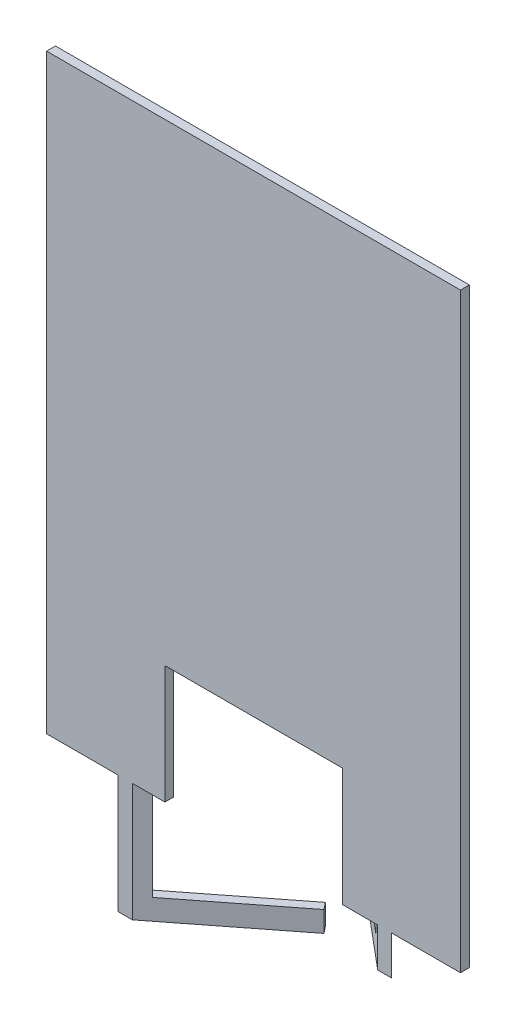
ISO-10303-21;
HEADER;
FILE_DESCRIPTION(('STEP AP214'),'2;1');
FILE_NAME('part.step','',(''),(''),'','','');
FILE_SCHEMA(('AUTOMOTIVE_DESIGN { 1 0 10303 214 1 1 1 1 }'));
ENDSEC;
DATA;
#1=APPLICATION_CONTEXT('core data for automotive mechanical design processes');
#2=APPLICATION_PROTOCOL_DEFINITION('international standard','automotive_design',2000,#1);
#3=PRODUCT_CONTEXT('',#1,'mechanical');
#4=PRODUCT('Part','Part','',(#3));
#5=PRODUCT_RELATED_PRODUCT_CATEGORY('part','',(#4));
#6=PRODUCT_DEFINITION_FORMATION('','',#4);
#7=PRODUCT_DEFINITION_CONTEXT('part definition',#1,'design');
#8=PRODUCT_DEFINITION('design','',#6,#7);
#9=PRODUCT_DEFINITION_SHAPE('','',#8);
#10=(LENGTH_UNIT() NAMED_UNIT(*) SI_UNIT(.MILLI.,.METRE.));
#11=(NAMED_UNIT(*) PLANE_ANGLE_UNIT() SI_UNIT($,.RADIAN.));
#12=(NAMED_UNIT(*) SI_UNIT($,.STERADIAN.) SOLID_ANGLE_UNIT());
#13=UNCERTAINTY_MEASURE_WITH_UNIT(LENGTH_MEASURE(1.E-05),#10,'distance_accuracy_value','');
#14=(GEOMETRIC_REPRESENTATION_CONTEXT(3) GLOBAL_UNCERTAINTY_ASSIGNED_CONTEXT((#13)) GLOBAL_UNIT_ASSIGNED_CONTEXT((#10,
#11,#12)) REPRESENTATION_CONTEXT('',''));
#15=CARTESIAN_POINT('',(0.,0.,0.));
#16=DIRECTION('',(0.,0.,1.));
#17=DIRECTION('',(1.,0.,0.));
#18=AXIS2_PLACEMENT_3D('',#15,#16,#17);
#19=CARTESIAN_POINT('',(88.9,-254.,3.81));
#20=DIRECTION('',(0.,1.,0.));
#21=DIRECTION('',(0.,0.,1.));
#22=AXIS2_PLACEMENT_3D('',#19,#20,#21);
#23=PLANE('',#22);
#24=DIRECTION('',(1.,0.,0.));
#25=VECTOR('',#24,1.);
#26=CARTESIAN_POINT('',(88.9,-254.,3.81));
#27=LINE('',#26,#25);
#28=CARTESIAN_POINT('',(38.1,-254.,3.81));
#29=VERTEX_POINT('',#28);
#30=CARTESIAN_POINT('',(53.34,-254.,3.81));
#31=VERTEX_POINT('',#30);
#32=EDGE_CURVE('E251',#29,#31,#27,.T.);
#33=ORIENTED_EDGE('',*,*,#32,.F.);
#34=DIRECTION('',(0.,0.,-1.));
#35=VECTOR('',#34,1.);
#36=CARTESIAN_POINT('',(38.1,-254.,3.81));
#37=LINE('',#36,#35);
#38=CARTESIAN_POINT('',(38.1,-254.,0.));
#39=VERTEX_POINT('',#38);
#40=EDGE_CURVE('E237',#29,#39,#37,.T.);
#41=ORIENTED_EDGE('',*,*,#40,.T.);
#42=DIRECTION('',(1.,0.,0.));
#43=VECTOR('',#42,1.);
#44=CARTESIAN_POINT('',(88.9,-254.,0.));
#45=LINE('',#44,#43);
#46=CARTESIAN_POINT('',(48.7994188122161,-254.,0.));
#47=VERTEX_POINT('',#46);
#48=EDGE_CURVE('E286',#39,#47,#45,.T.);
#49=ORIENTED_EDGE('',*,*,#48,.T.);
#50=DIRECTION('',(0.766044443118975,0.,0.642787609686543));
#51=VECTOR('',#50,1.);
#52=CARTESIAN_POINT('',(74.2074645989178,-254.,21.3198818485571));
#53=LINE('',#52,#51);
#54=EDGE_CURVE('E258',#47,#31,#53,.T.);
#55=ORIENTED_EDGE('',*,*,#54,.T.);
#56=EDGE_LOOP('',(#33,#41,#49,#55));
#57=FACE_BOUND('',#56,.T.);
#58=ADVANCED_FACE('F35',(#57),#23,.F.);
#59=CARTESIAN_POINT('',(59.2673077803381,-147.32,3.81));
#60=DIRECTION('',(0.642787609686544,0.,-0.766044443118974));
#61=DIRECTION('',(-0.766044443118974,0.,-0.642787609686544));
#62=AXIS2_PLACEMENT_3D('',#59,#60,#61);
#63=PLANE('',#62);
#64=DIRECTION('',(0.766044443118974,0.,0.642787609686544));
#65=VECTOR('',#64,1.);
#66=CARTESIAN_POINT('',(59.2673077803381,-156.21,3.81));
#67=LINE('',#66,#65);
#68=CARTESIAN_POINT('',(14.5149914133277,-156.21,-33.7416521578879));
#69=VERTEX_POINT('',#68);
#70=CARTESIAN_POINT('',(54.7267265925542,-156.21,0.));
#71=VERTEX_POINT('',#70);
#72=EDGE_CURVE('E451',#69,#71,#67,.T.);
#73=ORIENTED_EDGE('',*,*,#72,.F.);
#74=DIRECTION('',(0.,-1.,0.));
#75=VECTOR('',#74,1.);
#76=CARTESIAN_POINT('',(14.5149914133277,-147.32,-33.7416521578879));
#77=LINE('',#76,#75);
#78=CARTESIAN_POINT('',(14.5149914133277,-147.32,-33.7416521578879));
#79=VERTEX_POINT('',#78);
#80=EDGE_CURVE('E346',#79,#69,#77,.T.);
#81=ORIENTED_EDGE('',*,*,#80,.F.);
#82=DIRECTION('',(0.766044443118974,0.,0.642787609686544));
#83=VECTOR('',#82,1.);
#84=CARTESIAN_POINT('',(59.2673077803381,-147.32,3.81));
#85=LINE('',#84,#83);
#86=CARTESIAN_POINT('',(54.7267265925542,-147.32,0.));
#87=VERTEX_POINT('',#86);
#88=EDGE_CURVE('E382',#79,#87,#85,.T.);
#89=ORIENTED_EDGE('',*,*,#88,.T.);
#90=DIRECTION('',(0.,1.,0.));
#91=VECTOR('',#90,1.);
#92=CARTESIAN_POINT('',(54.7267265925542,0.,0.));
#93=LINE('',#92,#91);
#94=EDGE_CURVE('E307',#71,#87,#93,.T.);
#95=ORIENTED_EDGE('',*,*,#94,.F.);
#96=EDGE_LOOP('',(#73,#81,#89,#95));
#97=FACE_BOUND('',#96,.T.);
#98=ADVANCED_FACE('F575',(#97),#63,.T.);
#99=CARTESIAN_POINT('',(12.0659706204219,-147.32,-30.8230228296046));
#100=DIRECTION('',(-0.642787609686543,0.,0.766044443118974));
#101=DIRECTION('',(0.766044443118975,0.,0.642787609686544));
#102=AXIS2_PLACEMENT_3D('',#99,#100,#101);
#103=PLANE('',#102);
#104=DIRECTION('',(-0.766044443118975,0.,-0.642787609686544));
#105=VECTOR('',#104,1.);
#106=CARTESIAN_POINT('',(12.0659706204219,-156.21,-30.8230228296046));
#107=LINE('',#106,#105);
#108=CARTESIAN_POINT('',(48.7994188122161,-156.21,0.));
#109=VERTEX_POINT('',#108);
#110=CARTESIAN_POINT('',(12.0659706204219,-156.21,-30.8230228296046));
#111=VERTEX_POINT('',#110);
#112=EDGE_CURVE('E449',#109,#111,#107,.T.);
#113=ORIENTED_EDGE('',*,*,#112,.F.);
#114=DIRECTION('',(0.,-1.,0.));
#115=VECTOR('',#114,1.);
#116=CARTESIAN_POINT('',(48.7994188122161,0.,0.));
#117=LINE('',#116,#115);
#118=CARTESIAN_POINT('',(48.7994188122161,-147.32,0.));
#119=VERTEX_POINT('',#118);
#120=EDGE_CURVE('E304',#119,#109,#117,.T.);
#121=ORIENTED_EDGE('',*,*,#120,.F.);
#122=DIRECTION('',(-0.766044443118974,0.,-0.642787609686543));
#123=VECTOR('',#122,1.);
#124=CARTESIAN_POINT('',(12.0659706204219,-147.32,-30.8230228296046));
#125=LINE('',#124,#123);
#126=CARTESIAN_POINT('',(12.0659706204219,-147.32,-30.8230228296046));
#127=VERTEX_POINT('',#126);
#128=EDGE_CURVE('E368',#119,#127,#125,.T.);
#129=ORIENTED_EDGE('',*,*,#128,.T.);
#130=DIRECTION('',(0.,-1.,0.));
#131=VECTOR('',#130,1.);
#132=CARTESIAN_POINT('',(12.0659706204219,-147.32,-30.8230228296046));
#133=LINE('',#132,#131);
#134=EDGE_CURVE('E387',#127,#111,#133,.T.);
#135=ORIENTED_EDGE('',*,*,#134,.T.);
#136=EDGE_LOOP('',(#113,#121,#129,#135));
#137=FACE_BOUND('',#136,.T.);
#138=ADVANCED_FACE('F579',(#137),#103,.T.);
#139=CARTESIAN_POINT('',(14.5149914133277,-147.32,-33.7416521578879));
#140=DIRECTION('',(-0.766044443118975,0.,-0.642787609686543));
#141=DIRECTION('',(-0.642787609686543,0.,0.766044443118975));
#142=AXIS2_PLACEMENT_3D('',#139,#140,#141);
#143=PLANE('',#142);
#144=DIRECTION('',(0.642787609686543,0.,-0.766044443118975));
#145=VECTOR('',#144,1.);
#146=CARTESIAN_POINT('',(14.5149914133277,-156.21,-33.7416521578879));
#147=LINE('',#146,#145);
#148=EDGE_CURVE('E328',#111,#69,#147,.T.);
#149=ORIENTED_EDGE('',*,*,#148,.F.);
#150=ORIENTED_EDGE('',*,*,#134,.F.);
#151=DIRECTION('',(0.642787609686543,0.,-0.766044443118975));
#152=VECTOR('',#151,1.);
#153=CARTESIAN_POINT('',(14.5149914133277,-147.32,-33.7416521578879));
#154=LINE('',#153,#152);
#155=EDGE_CURVE('E379',#127,#79,#154,.T.);
#156=ORIENTED_EDGE('',*,*,#155,.T.);
#157=ORIENTED_EDGE('',*,*,#80,.T.);
#158=EDGE_LOOP('',(#149,#150,#156,#157));
#159=FACE_BOUND('',#158,.T.);
#160=ADVANCED_FACE('F708',(#159),#143,.T.);
#161=CARTESIAN_POINT('',(0.,0.,0.));
#162=DIRECTION('',(0.,0.,1.));
#163=DIRECTION('',(1.,0.,0.));
#164=AXIS2_PLACEMENT_3D('',#161,#162,#163);
#165=PLANE('',#164);
#166=DIRECTION('',(1.,0.,0.));
#167=VECTOR('',#166,1.);
#168=CARTESIAN_POINT('',(12.0659706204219,-156.21,0.));
#169=LINE('',#168,#167);
#170=EDGE_CURVE('E441',#109,#71,#169,.T.);
#171=ORIENTED_EDGE('',*,*,#170,.T.);
#172=ORIENTED_EDGE('',*,*,#94,.T.);
#173=DIRECTION('',(1.,0.,0.));
#174=VECTOR('',#173,1.);
#175=CARTESIAN_POINT('',(0.,-147.32,0.));
#176=LINE('',#175,#174);
#177=EDGE_CURVE('E301',#119,#87,#176,.T.);
#178=ORIENTED_EDGE('',*,*,#177,.F.);
#179=ORIENTED_EDGE('',*,*,#120,.T.);
#180=EDGE_LOOP('',(#171,#172,#178,#179));
#181=FACE_BOUND('',#180,.T.);
#182=ORIENTED_EDGE('',*,*,#48,.F.);
#183=DIRECTION('',(0.,-1.,0.));
#184=VECTOR('',#183,1.);
#185=CARTESIAN_POINT('',(38.1,-254.,0.));
#186=LINE('',#185,#184);
#187=CARTESIAN_POINT('',(38.1,-203.2,0.));
#188=VERTEX_POINT('',#187);
#189=EDGE_CURVE('E242',#188,#39,#186,.T.);
#190=ORIENTED_EDGE('',*,*,#189,.F.);
#191=DIRECTION('',(1.,0.,0.));
#192=VECTOR('',#191,1.);
#193=CARTESIAN_POINT('',(38.1,-203.2,0.));
#194=LINE('',#193,#192);
#195=CARTESIAN_POINT('',(-38.1,-203.2,0.));
#196=VERTEX_POINT('',#195);
#197=EDGE_CURVE('E255',#196,#188,#194,.T.);
#198=ORIENTED_EDGE('',*,*,#197,.F.);
#199=DIRECTION('',(0.,1.,0.));
#200=VECTOR('',#199,1.);
#201=CARTESIAN_POINT('',(-38.1,-254.,0.));
#202=LINE('',#201,#200);
#203=CARTESIAN_POINT('',(-38.1,-254.,0.));
#204=VERTEX_POINT('',#203);
#205=EDGE_CURVE('E426',#204,#196,#202,.T.);
#206=ORIENTED_EDGE('',*,*,#205,.F.);
#207=CARTESIAN_POINT('',(-47.1934223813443,-254.,0.));
#208=VERTEX_POINT('',#207);
#209=EDGE_CURVE('E285',#208,#204,#45,.T.);
#210=ORIENTED_EDGE('',*,*,#209,.F.);
#211=DIRECTION('',(0.,-1.,0.));
#212=VECTOR('',#211,1.);
#213=CARTESIAN_POINT('',(-47.1934223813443,-114.3,0.));
#214=LINE('',#213,#212);
#215=CARTESIAN_POINT('',(-47.1934223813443,-295.91,0.));
#216=VERTEX_POINT('',#215);
#217=EDGE_CURVE('E422',#208,#216,#214,.T.);
#218=ORIENTED_EDGE('',*,*,#217,.T.);
#219=DIRECTION('',(-1.,0.,0.));
#220=VECTOR('',#219,1.);
#221=CARTESIAN_POINT('',(-5.87411275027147,-295.91,0.));
#222=LINE('',#221,#220);
#223=CARTESIAN_POINT('',(-53.3818882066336,-295.91,0.));
#224=VERTEX_POINT('',#223);
#225=EDGE_CURVE('E475',#216,#224,#222,.T.);
#226=ORIENTED_EDGE('',*,*,#225,.T.);
#227=DIRECTION('',(0.,1.,0.));
#228=VECTOR('',#227,1.);
#229=CARTESIAN_POINT('',(-53.3818882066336,-114.3,0.));
#230=LINE('',#229,#228);
#231=CARTESIAN_POINT('',(-53.3818882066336,-254.,0.));
#232=VERTEX_POINT('',#231);
#233=EDGE_CURVE('E324',#224,#232,#230,.T.);
#234=ORIENTED_EDGE('',*,*,#233,.T.);
#235=CARTESIAN_POINT('',(-88.9,-254.,0.));
#236=VERTEX_POINT('',#235);
#237=EDGE_CURVE('E281',#236,#232,#45,.T.);
#238=ORIENTED_EDGE('',*,*,#237,.F.);
#239=DIRECTION('',(0.,-1.,0.));
#240=VECTOR('',#239,1.);
#241=CARTESIAN_POINT('',(-88.9,-254.,0.));
#242=LINE('',#241,#240);
#243=CARTESIAN_POINT('',(-88.9,0.,0.));
#244=VERTEX_POINT('',#243);
#245=EDGE_CURVE('E277',#244,#236,#242,.T.);
#246=ORIENTED_EDGE('',*,*,#245,.F.);
#247=DIRECTION('',(-1.,0.,0.));
#248=VECTOR('',#247,1.);
#249=CARTESIAN_POINT('',(88.9,0.,0.));
#250=LINE('',#249,#248);
#251=CARTESIAN_POINT('',(88.9,0.,0.));
#252=VERTEX_POINT('',#251);
#253=EDGE_CURVE('E288',#252,#244,#250,.T.);
#254=ORIENTED_EDGE('',*,*,#253,.F.);
#255=DIRECTION('',(0.,1.,0.));
#256=VECTOR('',#255,1.);
#257=CARTESIAN_POINT('',(88.9,-254.,0.));
#258=LINE('',#257,#256);
#259=CARTESIAN_POINT('',(88.9,-254.,0.));
#260=VERTEX_POINT('',#259);
#261=EDGE_CURVE('E284',#260,#252,#258,.T.);
#262=ORIENTED_EDGE('',*,*,#261,.F.);
#263=CARTESIAN_POINT('',(54.7267265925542,-254.,0.));
#264=VERTEX_POINT('',#263);
#265=EDGE_CURVE('E279',#264,#260,#45,.T.);
#266=ORIENTED_EDGE('',*,*,#265,.F.);
#267=DIRECTION('',(0.,-1.,0.));
#268=VECTOR('',#267,1.);
#269=CARTESIAN_POINT('',(54.7267265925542,-147.32,0.));
#270=LINE('',#269,#268);
#271=CARTESIAN_POINT('',(54.7267265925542,-261.874,0.));
#272=VERTEX_POINT('',#271);
#273=EDGE_CURVE('E407',#264,#272,#270,.T.);
#274=ORIENTED_EDGE('',*,*,#273,.T.);
#275=DIRECTION('',(1.,0.,0.));
#276=VECTOR('',#275,1.);
#277=CARTESIAN_POINT('',(12.0659706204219,-261.874,0.));
#278=LINE('',#277,#276);
#279=CARTESIAN_POINT('',(48.7994188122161,-261.874,0.));
#280=VERTEX_POINT('',#279);
#281=EDGE_CURVE('E336',#280,#272,#278,.T.);
#282=ORIENTED_EDGE('',*,*,#281,.F.);
#283=DIRECTION('',(0.,1.,0.));
#284=VECTOR('',#283,1.);
#285=CARTESIAN_POINT('',(48.7994188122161,-147.32,0.));
#286=LINE('',#285,#284);
#287=EDGE_CURVE('E43',#280,#47,#286,.T.);
#288=ORIENTED_EDGE('',*,*,#287,.T.);
#289=EDGE_LOOP('',(#182,#190,#198,#206,#210,#218,#226,#234,#238,#246,#254,#262,#266,#274,#282,#288));
#290=FACE_BOUND('',#289,.T.);
#291=DIRECTION('',(1.,0.,0.));
#292=VECTOR('',#291,1.);
#293=CARTESIAN_POINT('',(-5.87411275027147,-116.84,0.));
#294=LINE('',#293,#292);
#295=CARTESIAN_POINT('',(-47.1934223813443,-116.84,0.));
#296=VERTEX_POINT('',#295);
#297=CARTESIAN_POINT('',(-5.87411275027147,-116.84,0.));
#298=VERTEX_POINT('',#297);
#299=EDGE_CURVE('E457',#296,#298,#294,.T.);
#300=ORIENTED_EDGE('',*,*,#299,.F.);
#301=DIRECTION('',(0.,1.,0.));
#302=VECTOR('',#301,1.);
#303=CARTESIAN_POINT('',(-47.1934223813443,0.,0.));
#304=LINE('',#303,#302);
#305=CARTESIAN_POINT('',(-47.1934223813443,-114.3,0.));
#306=VERTEX_POINT('',#305);
#307=EDGE_CURVE('E315',#296,#306,#304,.T.);
#308=ORIENTED_EDGE('',*,*,#307,.T.);
#309=DIRECTION('',(-1.,0.,0.));
#310=VECTOR('',#309,1.);
#311=CARTESIAN_POINT('',(0.,-114.3,0.));
#312=LINE('',#311,#310);
#313=CARTESIAN_POINT('',(-53.3818882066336,-114.3,0.));
#314=VERTEX_POINT('',#313);
#315=EDGE_CURVE('E309',#306,#314,#312,.T.);
#316=ORIENTED_EDGE('',*,*,#315,.T.);
#317=DIRECTION('',(0.,-1.,0.));
#318=VECTOR('',#317,1.);
#319=CARTESIAN_POINT('',(-53.3818882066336,0.,0.));
#320=LINE('',#319,#318);
#321=CARTESIAN_POINT('',(-53.3818882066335,-123.19,0.));
#322=VERTEX_POINT('',#321);
#323=EDGE_CURVE('E312',#314,#322,#320,.T.);
#324=ORIENTED_EDGE('',*,*,#323,.T.);
#325=DIRECTION('',(-1.,0.,0.));
#326=VECTOR('',#325,1.);
#327=CARTESIAN_POINT('',(-5.87411275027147,-123.19,0.));
#328=LINE('',#327,#326);
#329=CARTESIAN_POINT('',(-47.1934223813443,-123.19,0.));
#330=VERTEX_POINT('',#329);
#331=EDGE_CURVE('E474',#330,#322,#328,.T.);
#332=ORIENTED_EDGE('',*,*,#331,.F.);
#333=CARTESIAN_POINT('',(-47.1934223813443,-120.65,0.));
#334=VERTEX_POINT('',#333);
#335=EDGE_CURVE('E316',#330,#334,#304,.T.);
#336=ORIENTED_EDGE('',*,*,#335,.T.);
#337=DIRECTION('',(1.,0.,0.));
#338=VECTOR('',#337,1.);
#339=CARTESIAN_POINT('',(-5.87411275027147,-120.65,0.));
#340=LINE('',#339,#338);
#341=CARTESIAN_POINT('',(-5.87411275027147,-120.65,0.));
#342=VERTEX_POINT('',#341);
#343=EDGE_CURVE('E465',#334,#342,#340,.T.);
#344=ORIENTED_EDGE('',*,*,#343,.T.);
#345=DIRECTION('',(0.,-1.,0.));
#346=VECTOR('',#345,1.);
#347=CARTESIAN_POINT('',(-5.87411275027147,-116.84,0.));
#348=LINE('',#347,#346);
#349=EDGE_CURVE('E472',#298,#342,#348,.T.);
#350=ORIENTED_EDGE('',*,*,#349,.F.);
#351=EDGE_LOOP('',(#300,#308,#316,#324,#332,#336,#344,#350));
#352=FACE_BOUND('',#351,.T.);
#353=ADVANCED_FACE('F333',(#181,#290,#352),#165,.F.);
#354=CARTESIAN_POINT('',(-5.87411275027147,-114.3,-32.2821827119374));
#355=DIRECTION('',(0.615661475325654,0.,0.788010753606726));
#356=DIRECTION('',(0.788010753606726,0.,-0.615661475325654));
#357=AXIS2_PLACEMENT_3D('',#354,#355,#356);
#358=PLANE('',#357);
#359=ORIENTED_EDGE('',*,*,#307,.F.);
#360=DIRECTION('',(-0.788010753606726,0.,0.615661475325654));
#361=VECTOR('',#360,1.);
#362=CARTESIAN_POINT('',(-47.1934223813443,-116.84,0.));
#363=LINE('',#362,#361);
#364=CARTESIAN_POINT('',(-5.87411275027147,-116.84,-32.2821827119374));
#365=VERTEX_POINT('',#364);
#366=EDGE_CURVE('E455',#365,#296,#363,.T.);
#367=ORIENTED_EDGE('',*,*,#366,.F.);
#368=DIRECTION('',(0.,-1.,0.));
#369=VECTOR('',#368,1.);
#370=CARTESIAN_POINT('',(-5.87411275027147,-114.3,-32.2821827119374));
#371=LINE('',#370,#369);
#372=CARTESIAN_POINT('',(-5.87411275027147,-114.3,-32.2821827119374));
#373=VERTEX_POINT('',#372);
#374=EDGE_CURVE('E365',#373,#365,#371,.T.);
#375=ORIENTED_EDGE('',*,*,#374,.F.);
#376=DIRECTION('',(-0.788010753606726,0.,0.615661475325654));
#377=VECTOR('',#376,1.);
#378=CARTESIAN_POINT('',(-5.87411275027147,-114.3,-32.2821827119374));
#379=LINE('',#378,#377);
#380=EDGE_CURVE('E488',#373,#306,#379,.T.);
#381=ORIENTED_EDGE('',*,*,#380,.T.);
#382=EDGE_LOOP('',(#359,#367,#375,#381));
#383=FACE_BOUND('',#382,.T.);
#384=ADVANCED_FACE('F552',(#383),#358,.T.);
#385=ORIENTED_EDGE('',*,*,#217,.F.);
#386=DIRECTION('',(0.788010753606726,0.,-0.615661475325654));
#387=VECTOR('',#386,1.);
#388=CARTESIAN_POINT('',(35.4668648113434,-254.,-64.5812942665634));
#389=LINE('',#388,#387);
#390=CARTESIAN_POINT('',(-52.07,-254.,3.81));
#391=VERTEX_POINT('',#390);
#392=EDGE_CURVE('E364',#391,#208,#389,.T.);
#393=ORIENTED_EDGE('',*,*,#392,.F.);
#394=DIRECTION('',(0.,-1.,0.));
#395=VECTOR('',#394,1.);
#396=CARTESIAN_POINT('',(-52.07,-114.3,3.81));
#397=LINE('',#396,#395);
#398=CARTESIAN_POINT('',(-52.07,-304.8,3.81));
#399=VERTEX_POINT('',#398);
#400=EDGE_CURVE('E375',#391,#399,#397,.T.);
#401=ORIENTED_EDGE('',*,*,#400,.T.);
#402=DIRECTION('',(-0.788010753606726,0.,0.615661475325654));
#403=VECTOR('',#402,1.);
#404=CARTESIAN_POINT('',(-5.87411275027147,-304.8,-32.2821827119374));
#405=LINE('',#404,#403);
#406=CARTESIAN_POINT('',(-5.87411275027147,-304.8,-32.2821827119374));
#407=VERTEX_POINT('',#406);
#408=EDGE_CURVE('E487',#407,#399,#405,.T.);
#409=ORIENTED_EDGE('',*,*,#408,.F.);
#410=CARTESIAN_POINT('',(-5.87411275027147,-295.91,-32.2821827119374));
#411=VERTEX_POINT('',#410);
#412=EDGE_CURVE('E373',#411,#407,#371,.T.);
#413=ORIENTED_EDGE('',*,*,#412,.F.);
#414=DIRECTION('',(0.788010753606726,0.,-0.615661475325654));
#415=VECTOR('',#414,1.);
#416=CARTESIAN_POINT('',(-5.87411275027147,-295.91,-32.2821827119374));
#417=LINE('',#416,#415);
#418=EDGE_CURVE('E484',#216,#411,#417,.T.);
#419=ORIENTED_EDGE('',*,*,#418,.F.);
#420=EDGE_LOOP('',(#385,#393,#401,#409,#413,#419));
#421=FACE_BOUND('',#420,.T.);
#422=ADVANCED_FACE('F516',(#421),#358,.T.);
#423=CARTESIAN_POINT('',(-58.2584658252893,-114.3,3.81));
#424=DIRECTION('',(-0.615661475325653,0.,-0.788010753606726));
#425=DIRECTION('',(-0.788010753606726,0.,0.615661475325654));
#426=AXIS2_PLACEMENT_3D('',#423,#424,#425);
#427=PLANE('',#426);
#428=ORIENTED_EDGE('',*,*,#233,.F.);
#429=DIRECTION('',(-0.788010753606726,0.,0.615661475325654));
#430=VECTOR('',#429,1.);
#431=CARTESIAN_POINT('',(-58.2584658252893,-295.91,3.81));
#432=LINE('',#431,#430);
#433=CARTESIAN_POINT('',(-8.2197829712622,-295.91,-35.284503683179));
#434=VERTEX_POINT('',#433);
#435=EDGE_CURVE('E482',#434,#224,#432,.T.);
#436=ORIENTED_EDGE('',*,*,#435,.F.);
#437=DIRECTION('',(0.,-1.,0.));
#438=VECTOR('',#437,1.);
#439=CARTESIAN_POINT('',(-8.2197829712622,-114.3,-35.284503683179));
#440=LINE('',#439,#438);
#441=CARTESIAN_POINT('',(-8.2197829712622,-304.8,-35.284503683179));
#442=VERTEX_POINT('',#441);
#443=EDGE_CURVE('E509',#434,#442,#440,.T.);
#444=ORIENTED_EDGE('',*,*,#443,.T.);
#445=DIRECTION('',(0.788010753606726,0.,-0.615661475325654));
#446=VECTOR('',#445,1.);
#447=CARTESIAN_POINT('',(-58.2584658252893,-304.8,3.81));
#448=LINE('',#447,#446);
#449=CARTESIAN_POINT('',(-58.2584658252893,-304.8,3.81));
#450=VERTEX_POINT('',#449);
#451=EDGE_CURVE('E502',#450,#442,#448,.T.);
#452=ORIENTED_EDGE('',*,*,#451,.F.);
#453=DIRECTION('',(0.,-1.,0.));
#454=VECTOR('',#453,1.);
#455=CARTESIAN_POINT('',(-58.2584658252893,-114.3,3.81));
#456=LINE('',#455,#454);
#457=CARTESIAN_POINT('',(-58.2584658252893,-254.,3.81));
#458=VERTEX_POINT('',#457);
#459=EDGE_CURVE('E510',#458,#450,#456,.T.);
#460=ORIENTED_EDGE('',*,*,#459,.F.);
#461=DIRECTION('',(-0.788010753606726,0.,0.615661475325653));
#462=VECTOR('',#461,1.);
#463=CARTESIAN_POINT('',(33.1211945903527,-254.,-67.583615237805));
#464=LINE('',#463,#462);
#465=EDGE_CURVE('E361',#232,#458,#464,.T.);
#466=ORIENTED_EDGE('',*,*,#465,.F.);
#467=EDGE_LOOP('',(#428,#436,#444,#452,#460,#466));
#468=FACE_BOUND('',#467,.T.);
#469=ADVANCED_FACE('F623',(#468),#427,.T.);
#470=CARTESIAN_POINT('',(-8.2197829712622,-114.3,-35.284503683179));
#471=DIRECTION('',(0.788010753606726,0.,-0.615661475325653));
#472=DIRECTION('',(-0.615661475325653,0.,-0.788010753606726));
#473=AXIS2_PLACEMENT_3D('',#470,#471,#472);
#474=PLANE('',#473);
#475=DIRECTION('',(-0.615661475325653,0.,-0.788010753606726));
#476=VECTOR('',#475,1.);
#477=CARTESIAN_POINT('',(-8.2197829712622,-295.91,-35.284503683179));
#478=LINE('',#477,#476);
#479=EDGE_CURVE('E322',#411,#434,#478,.T.);
#480=ORIENTED_EDGE('',*,*,#479,.F.);
#481=ORIENTED_EDGE('',*,*,#412,.T.);
#482=DIRECTION('',(0.615661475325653,0.,0.788010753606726));
#483=VECTOR('',#482,1.);
#484=CARTESIAN_POINT('',(-8.2197829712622,-304.8,-35.284503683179));
#485=LINE('',#484,#483);
#486=EDGE_CURVE('E492',#442,#407,#485,.T.);
#487=ORIENTED_EDGE('',*,*,#486,.F.);
#488=ORIENTED_EDGE('',*,*,#443,.F.);
#489=EDGE_LOOP('',(#480,#481,#487,#488));
#490=FACE_BOUND('',#489,.T.);
#491=ADVANCED_FACE('F524',(#490),#474,.T.);
#492=ORIENTED_EDGE('',*,*,#209,.T.);
#493=DIRECTION('',(0.,0.,-1.));
#494=VECTOR('',#493,1.);
#495=CARTESIAN_POINT('',(-38.1,-254.,3.81));
#496=LINE('',#495,#494);
#497=CARTESIAN_POINT('',(-38.1,-254.,3.81));
#498=VERTEX_POINT('',#497);
#499=EDGE_CURVE('E246',#498,#204,#496,.T.);
#500=ORIENTED_EDGE('',*,*,#499,.F.);
#501=EDGE_CURVE('E260',#391,#498,#27,.T.);
#502=ORIENTED_EDGE('',*,*,#501,.F.);
#503=ORIENTED_EDGE('',*,*,#392,.T.);
#504=EDGE_LOOP('',(#492,#500,#502,#503));
#505=FACE_BOUND('',#504,.T.);
#506=ADVANCED_FACE('F418',(#505),#23,.F.);
#507=CARTESIAN_POINT('',(59.2673077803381,-254.,3.81));
#508=VERTEX_POINT('',#507);
#509=CARTESIAN_POINT('',(88.9,-254.,3.81));
#510=VERTEX_POINT('',#509);
#511=EDGE_CURVE('E261',#508,#510,#27,.T.);
#512=ORIENTED_EDGE('',*,*,#511,.F.);
#513=DIRECTION('',(-0.766044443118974,0.,-0.642787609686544));
#514=VECTOR('',#513,1.);
#515=CARTESIAN_POINT('',(76.6564853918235,-254.,18.4012525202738));
#516=LINE('',#515,#514);
#517=EDGE_CURVE('E280',#508,#264,#516,.T.);
#518=ORIENTED_EDGE('',*,*,#517,.T.);
#519=ORIENTED_EDGE('',*,*,#265,.T.);
#520=DIRECTION('',(0.,0.,-1.));
#521=VECTOR('',#520,1.);
#522=CARTESIAN_POINT('',(88.9,-254.,3.81));
#523=LINE('',#522,#521);
#524=EDGE_CURVE('E295',#510,#260,#523,.T.);
#525=ORIENTED_EDGE('',*,*,#524,.F.);
#526=EDGE_LOOP('',(#512,#518,#519,#525));
#527=FACE_BOUND('',#526,.T.);
#528=ADVANCED_FACE('F410',(#527),#23,.F.);
#529=CARTESIAN_POINT('',(-88.9,-254.,3.81));
#530=DIRECTION('',(1.,0.,0.));
#531=DIRECTION('',(0.,0.,-1.));
#532=AXIS2_PLACEMENT_3D('',#529,#530,#531);
#533=PLANE('',#532);
#534=ORIENTED_EDGE('',*,*,#245,.T.);
#535=DIRECTION('',(0.,0.,-1.));
#536=VECTOR('',#535,1.);
#537=CARTESIAN_POINT('',(-88.9,-254.,3.81));
#538=LINE('',#537,#536);
#539=CARTESIAN_POINT('',(-88.9,-254.,3.81));
#540=VERTEX_POINT('',#539);
#541=EDGE_CURVE('E298',#540,#236,#538,.T.);
#542=ORIENTED_EDGE('',*,*,#541,.F.);
#543=DIRECTION('',(0.,-1.,0.));
#544=VECTOR('',#543,1.);
#545=CARTESIAN_POINT('',(-88.9,-254.,3.81));
#546=LINE('',#545,#544);
#547=CARTESIAN_POINT('',(-88.9,0.,3.81));
#548=VERTEX_POINT('',#547);
#549=EDGE_CURVE('E265',#548,#540,#546,.T.);
#550=ORIENTED_EDGE('',*,*,#549,.F.);
#551=DIRECTION('',(0.,0.,-1.));
#552=VECTOR('',#551,1.);
#553=CARTESIAN_POINT('',(-88.9,0.,3.81));
#554=LINE('',#553,#552);
#555=EDGE_CURVE('E274',#548,#244,#554,.T.);
#556=ORIENTED_EDGE('',*,*,#555,.T.);
#557=EDGE_LOOP('',(#534,#542,#550,#556));
#558=FACE_BOUND('',#557,.T.);
#559=ADVANCED_FACE('F37',(#558),#533,.F.);
#560=ORIENTED_EDGE('',*,*,#237,.T.);
#561=ORIENTED_EDGE('',*,*,#465,.T.);
#562=EDGE_CURVE('E263',#540,#458,#27,.T.);
#563=ORIENTED_EDGE('',*,*,#562,.F.);
#564=ORIENTED_EDGE('',*,*,#541,.T.);
#565=EDGE_LOOP('',(#560,#561,#563,#564));
#566=FACE_BOUND('',#565,.T.);
#567=ADVANCED_FACE('F358',(#566),#23,.F.);
#568=CARTESIAN_POINT('',(88.9,-254.,3.81));
#569=DIRECTION('',(-1.,0.,0.));
#570=DIRECTION('',(0.,0.,1.));
#571=AXIS2_PLACEMENT_3D('',#568,#569,#570);
#572=PLANE('',#571);
#573=ORIENTED_EDGE('',*,*,#261,.T.);
#574=DIRECTION('',(0.,0.,-1.));
#575=VECTOR('',#574,1.);
#576=CARTESIAN_POINT('',(88.9,0.,3.81));
#577=LINE('',#576,#575);
#578=CARTESIAN_POINT('',(88.9,0.,3.81));
#579=VERTEX_POINT('',#578);
#580=EDGE_CURVE('E292',#579,#252,#577,.T.);
#581=ORIENTED_EDGE('',*,*,#580,.F.);
#582=DIRECTION('',(0.,1.,0.));
#583=VECTOR('',#582,1.);
#584=CARTESIAN_POINT('',(88.9,-254.,3.81));
#585=LINE('',#584,#583);
#586=EDGE_CURVE('E269',#510,#579,#585,.T.);
#587=ORIENTED_EDGE('',*,*,#586,.F.);
#588=ORIENTED_EDGE('',*,*,#524,.T.);
#589=EDGE_LOOP('',(#573,#581,#587,#588));
#590=FACE_BOUND('',#589,.T.);
#591=ADVANCED_FACE('F585',(#590),#572,.F.);
#592=CARTESIAN_POINT('',(88.9,0.,3.81));
#593=DIRECTION('',(0.,-1.,0.));
#594=DIRECTION('',(0.,0.,-1.));
#595=AXIS2_PLACEMENT_3D('',#592,#593,#594);
#596=PLANE('',#595);
#597=ORIENTED_EDGE('',*,*,#253,.T.);
#598=ORIENTED_EDGE('',*,*,#555,.F.);
#599=DIRECTION('',(-1.,0.,0.));
#600=VECTOR('',#599,1.);
#601=CARTESIAN_POINT('',(88.9,0.,3.81));
#602=LINE('',#601,#600);
#603=EDGE_CURVE('E271',#579,#548,#602,.T.);
#604=ORIENTED_EDGE('',*,*,#603,.F.);
#605=ORIENTED_EDGE('',*,*,#580,.T.);
#606=EDGE_LOOP('',(#597,#598,#604,#605));
#607=FACE_BOUND('',#606,.T.);
#608=ADVANCED_FACE('F590',(#607),#596,.F.);
#609=CARTESIAN_POINT('',(0.,0.,3.81));
#610=DIRECTION('',(0.,0.,1.));
#611=DIRECTION('',(1.,0.,0.));
#612=AXIS2_PLACEMENT_3D('',#609,#610,#611);
#613=PLANE('',#612);
#614=DIRECTION('',(0.,-1.,0.));
#615=VECTOR('',#614,1.);
#616=CARTESIAN_POINT('',(38.1,-254.,3.81));
#617=LINE('',#616,#615);
#618=CARTESIAN_POINT('',(38.1,-203.2,3.81));
#619=VERTEX_POINT('',#618);
#620=EDGE_CURVE('E240',#619,#29,#617,.T.);
#621=ORIENTED_EDGE('',*,*,#620,.T.);
#622=ORIENTED_EDGE('',*,*,#32,.T.);
#623=DIRECTION('',(0.,-1.,0.));
#624=VECTOR('',#623,1.);
#625=CARTESIAN_POINT('',(53.34,-147.32,3.81));
#626=LINE('',#625,#624);
#627=CARTESIAN_POINT('',(53.34,-270.764,3.81));
#628=VERTEX_POINT('',#627);
#629=EDGE_CURVE('E340',#31,#628,#626,.T.);
#630=ORIENTED_EDGE('',*,*,#629,.T.);
#631=DIRECTION('',(-1.,0.,0.));
#632=VECTOR('',#631,1.);
#633=CARTESIAN_POINT('',(0.,-270.764,3.81));
#634=LINE('',#633,#632);
#635=CARTESIAN_POINT('',(59.2673077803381,-270.764,3.81));
#636=VERTEX_POINT('',#635);
#637=EDGE_CURVE('E398',#636,#628,#634,.T.);
#638=ORIENTED_EDGE('',*,*,#637,.F.);
#639=DIRECTION('',(0.,-1.,0.));
#640=VECTOR('',#639,1.);
#641=CARTESIAN_POINT('',(59.2673077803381,-147.32,3.81));
#642=LINE('',#641,#640);
#643=EDGE_CURVE('E341',#508,#636,#642,.T.);
#644=ORIENTED_EDGE('',*,*,#643,.F.);
#645=ORIENTED_EDGE('',*,*,#511,.T.);
#646=ORIENTED_EDGE('',*,*,#586,.T.);
#647=ORIENTED_EDGE('',*,*,#603,.T.);
#648=ORIENTED_EDGE('',*,*,#549,.T.);
#649=ORIENTED_EDGE('',*,*,#562,.T.);
#650=ORIENTED_EDGE('',*,*,#459,.T.);
#651=DIRECTION('',(-1.,0.,0.));
#652=VECTOR('',#651,1.);
#653=CARTESIAN_POINT('',(-52.07,-304.8,3.81));
#654=LINE('',#653,#652);
#655=EDGE_CURVE('E499',#399,#450,#654,.T.);
#656=ORIENTED_EDGE('',*,*,#655,.F.);
#657=ORIENTED_EDGE('',*,*,#400,.F.);
#658=ORIENTED_EDGE('',*,*,#501,.T.);
#659=DIRECTION('',(0.,1.,0.));
#660=VECTOR('',#659,1.);
#661=CARTESIAN_POINT('',(-38.1,-254.,3.81));
#662=LINE('',#661,#660);
#663=CARTESIAN_POINT('',(-38.1,-203.2,3.81));
#664=VERTEX_POINT('',#663);
#665=EDGE_CURVE('E254',#498,#664,#662,.T.);
#666=ORIENTED_EDGE('',*,*,#665,.T.);
#667=DIRECTION('',(1.,0.,0.));
#668=VECTOR('',#667,1.);
#669=CARTESIAN_POINT('',(38.1,-203.2,3.81));
#670=LINE('',#669,#668);
#671=EDGE_CURVE('E50',#664,#619,#670,.T.);
#672=ORIENTED_EDGE('',*,*,#671,.T.);
#673=EDGE_LOOP('',(#621,#622,#630,#638,#644,#645,#646,#647,#648,#649,#650,#656,#657,#658,#666,#672));
#674=FACE_BOUND('',#673,.T.);
#675=ADVANCED_FACE('F249',(#674),#613,.T.);
#676=DIRECTION('',(0.766044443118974,0.,0.642787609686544));
#677=VECTOR('',#676,1.);
#678=CARTESIAN_POINT('',(59.2673077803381,-270.764,3.81));
#679=LINE('',#678,#677);
#680=CARTESIAN_POINT('',(14.5149914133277,-270.764,-33.7416521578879));
#681=VERTEX_POINT('',#680);
#682=EDGE_CURVE('E399',#681,#636,#679,.T.);
#683=ORIENTED_EDGE('',*,*,#682,.F.);
#684=CARTESIAN_POINT('',(14.5149914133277,-261.874,-33.7416521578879));
#685=VERTEX_POINT('',#684);
#686=EDGE_CURVE('E386',#685,#681,#77,.T.);
#687=ORIENTED_EDGE('',*,*,#686,.F.);
#688=DIRECTION('',(-0.766044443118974,0.,-0.642787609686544));
#689=VECTOR('',#688,1.);
#690=CARTESIAN_POINT('',(59.2673077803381,-261.874,3.81));
#691=LINE('',#690,#689);
#692=EDGE_CURVE('E447',#272,#685,#691,.T.);
#693=ORIENTED_EDGE('',*,*,#692,.F.);
#694=ORIENTED_EDGE('',*,*,#273,.F.);
#695=ORIENTED_EDGE('',*,*,#517,.F.);
#696=ORIENTED_EDGE('',*,*,#643,.T.);
#697=EDGE_LOOP('',(#683,#687,#693,#694,#695,#696));
#698=FACE_BOUND('',#697,.T.);
#699=ADVANCED_FACE('F404',(#698),#63,.T.);
#700=DIRECTION('',(-0.766044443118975,0.,-0.642787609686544));
#701=VECTOR('',#700,1.);
#702=CARTESIAN_POINT('',(12.0659706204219,-270.764,-30.8230228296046));
#703=LINE('',#702,#701);
#704=CARTESIAN_POINT('',(12.0659706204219,-270.764,-30.8230228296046));
#705=VERTEX_POINT('',#704);
#706=EDGE_CURVE('E57',#628,#705,#703,.T.);
#707=ORIENTED_EDGE('',*,*,#706,.F.);
#708=ORIENTED_EDGE('',*,*,#629,.F.);
#709=ORIENTED_EDGE('',*,*,#54,.F.);
#710=ORIENTED_EDGE('',*,*,#287,.F.);
#711=DIRECTION('',(0.766044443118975,0.,0.642787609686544));
#712=VECTOR('',#711,1.);
#713=CARTESIAN_POINT('',(12.0659706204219,-261.874,-30.8230228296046));
#714=LINE('',#713,#712);
#715=CARTESIAN_POINT('',(12.0659706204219,-261.874,-30.8230228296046));
#716=VERTEX_POINT('',#715);
#717=EDGE_CURVE('E444',#716,#280,#714,.T.);
#718=ORIENTED_EDGE('',*,*,#717,.F.);
#719=EDGE_CURVE('E389',#716,#705,#133,.T.);
#720=ORIENTED_EDGE('',*,*,#719,.T.);
#721=EDGE_LOOP('',(#707,#708,#709,#710,#718,#720));
#722=FACE_BOUND('',#721,.T.);
#723=ADVANCED_FACE('F339',(#722),#103,.T.);
#724=CARTESIAN_POINT('',(0.,-147.32,0.));
#725=DIRECTION('',(0.,-1.,0.));
#726=DIRECTION('',(0.,0.,-1.));
#727=AXIS2_PLACEMENT_3D('',#724,#725,#726);
#728=PLANE('',#727);
#729=ORIENTED_EDGE('',*,*,#128,.F.);
#730=ORIENTED_EDGE('',*,*,#177,.T.);
#731=ORIENTED_EDGE('',*,*,#88,.F.);
#732=ORIENTED_EDGE('',*,*,#155,.F.);
#733=EDGE_LOOP('',(#729,#730,#731,#732));
#734=FACE_BOUND('',#733,.T.);
#735=ADVANCED_FACE('F782',(#734),#728,.F.);
#736=DIRECTION('',(0.642787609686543,0.,-0.766044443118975));
#737=VECTOR('',#736,1.);
#738=CARTESIAN_POINT('',(14.5149914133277,-270.764,-33.7416521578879));
#739=LINE('',#738,#737);
#740=EDGE_CURVE('E11',#705,#681,#739,.T.);
#741=ORIENTED_EDGE('',*,*,#740,.F.);
#742=ORIENTED_EDGE('',*,*,#719,.F.);
#743=DIRECTION('',(-0.642787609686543,0.,0.766044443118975));
#744=VECTOR('',#743,1.);
#745=CARTESIAN_POINT('',(14.5149914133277,-261.874,-33.7416521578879));
#746=LINE('',#745,#744);
#747=EDGE_CURVE('E326',#685,#716,#746,.T.);
#748=ORIENTED_EDGE('',*,*,#747,.F.);
#749=ORIENTED_EDGE('',*,*,#686,.T.);
#750=EDGE_LOOP('',(#741,#742,#748,#749));
#751=FACE_BOUND('',#750,.T.);
#752=ADVANCED_FACE('F665',(#751),#143,.T.);
#753=DIRECTION('',(-0.788010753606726,0.,0.615661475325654));
#754=VECTOR('',#753,1.);
#755=CARTESIAN_POINT('',(-47.1934223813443,-120.65,0.));
#756=LINE('',#755,#754);
#757=CARTESIAN_POINT('',(-5.87411275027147,-120.65,-32.2821827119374));
#758=VERTEX_POINT('',#757);
#759=EDGE_CURVE('E454',#758,#334,#756,.T.);
#760=ORIENTED_EDGE('',*,*,#759,.T.);
#761=ORIENTED_EDGE('',*,*,#335,.F.);
#762=DIRECTION('',(-0.788010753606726,0.,0.615661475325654));
#763=VECTOR('',#762,1.);
#764=CARTESIAN_POINT('',(-5.87411275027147,-123.19,-32.2821827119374));
#765=LINE('',#764,#763);
#766=CARTESIAN_POINT('',(-5.87411275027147,-123.19,-32.2821827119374));
#767=VERTEX_POINT('',#766);
#768=EDGE_CURVE('E480',#767,#330,#765,.T.);
#769=ORIENTED_EDGE('',*,*,#768,.F.);
#770=EDGE_CURVE('E371',#758,#767,#371,.T.);
#771=ORIENTED_EDGE('',*,*,#770,.F.);
#772=EDGE_LOOP('',(#760,#761,#769,#771));
#773=FACE_BOUND('',#772,.T.);
#774=ADVANCED_FACE('F539',(#773),#358,.T.);
#775=DIRECTION('',(0.788010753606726,0.,-0.615661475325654));
#776=VECTOR('',#775,1.);
#777=CARTESIAN_POINT('',(-58.2584658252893,-123.19,3.81));
#778=LINE('',#777,#776);
#779=CARTESIAN_POINT('',(-8.2197829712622,-123.19,-35.284503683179));
#780=VERTEX_POINT('',#779);
#781=EDGE_CURVE('E477',#322,#780,#778,.T.);
#782=ORIENTED_EDGE('',*,*,#781,.F.);
#783=ORIENTED_EDGE('',*,*,#323,.F.);
#784=DIRECTION('',(0.788010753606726,0.,-0.615661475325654));
#785=VECTOR('',#784,1.);
#786=CARTESIAN_POINT('',(-58.2584658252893,-114.3,3.81));
#787=LINE('',#786,#785);
#788=CARTESIAN_POINT('',(-8.2197829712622,-114.3,-35.284503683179));
#789=VERTEX_POINT('',#788);
#790=EDGE_CURVE('E491',#314,#789,#787,.T.);
#791=ORIENTED_EDGE('',*,*,#790,.T.);
#792=EDGE_CURVE('E507',#789,#780,#440,.T.);
#793=ORIENTED_EDGE('',*,*,#792,.T.);
#794=EDGE_LOOP('',(#782,#783,#791,#793));
#795=FACE_BOUND('',#794,.T.);
#796=ADVANCED_FACE('F544',(#795),#427,.T.);
#797=CARTESIAN_POINT('',(0.,-114.3,0.));
#798=DIRECTION('',(0.,1.,0.));
#799=DIRECTION('',(0.,0.,1.));
#800=AXIS2_PLACEMENT_3D('',#797,#798,#799);
#801=PLANE('',#800);
#802=ORIENTED_EDGE('',*,*,#315,.F.);
#803=ORIENTED_EDGE('',*,*,#380,.F.);
#804=DIRECTION('',(0.615661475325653,0.,0.788010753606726));
#805=VECTOR('',#804,1.);
#806=CARTESIAN_POINT('',(-8.2197829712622,-114.3,-35.284503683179));
#807=LINE('',#806,#805);
#808=EDGE_CURVE('E494',#789,#373,#807,.T.);
#809=ORIENTED_EDGE('',*,*,#808,.F.);
#810=ORIENTED_EDGE('',*,*,#790,.F.);
#811=EDGE_LOOP('',(#802,#803,#809,#810));
#812=FACE_BOUND('',#811,.T.);
#813=ADVANCED_FACE('F549',(#812),#801,.T.);
#814=DIRECTION('',(0.615661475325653,0.,0.788010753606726));
#815=VECTOR('',#814,1.);
#816=CARTESIAN_POINT('',(-8.2197829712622,-123.19,-35.284503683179));
#817=LINE('',#816,#815);
#818=EDGE_CURVE('E319',#780,#767,#817,.T.);
#819=ORIENTED_EDGE('',*,*,#818,.F.);
#820=ORIENTED_EDGE('',*,*,#792,.F.);
#821=ORIENTED_EDGE('',*,*,#808,.T.);
#822=ORIENTED_EDGE('',*,*,#374,.T.);
#823=DIRECTION('',(0.,-1.,0.));
#824=VECTOR('',#823,1.);
#825=CARTESIAN_POINT('',(-5.87411275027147,-116.84,-32.2821827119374));
#826=LINE('',#825,#824);
#827=EDGE_CURVE('E462',#365,#758,#826,.T.);
#828=ORIENTED_EDGE('',*,*,#827,.T.);
#829=ORIENTED_EDGE('',*,*,#770,.T.);
#830=EDGE_LOOP('',(#819,#820,#821,#822,#828,#829));
#831=FACE_BOUND('',#830,.T.);
#832=ADVANCED_FACE('F529',(#831),#474,.T.);
#833=CARTESIAN_POINT('',(0.,-304.8,0.));
#834=DIRECTION('',(0.,1.,0.));
#835=DIRECTION('',(0.,0.,1.));
#836=AXIS2_PLACEMENT_3D('',#833,#834,#835);
#837=PLANE('',#836);
#838=ORIENTED_EDGE('',*,*,#408,.T.);
#839=ORIENTED_EDGE('',*,*,#655,.T.);
#840=ORIENTED_EDGE('',*,*,#451,.T.);
#841=ORIENTED_EDGE('',*,*,#486,.T.);
#842=EDGE_LOOP('',(#838,#839,#840,#841));
#843=FACE_BOUND('',#842,.T.);
#844=ADVANCED_FACE('F519',(#843),#837,.F.);
#845=CARTESIAN_POINT('',(-5.87411275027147,-295.91,0.));
#846=DIRECTION('',(0.,-1.,0.));
#847=DIRECTION('',(0.,0.,-1.));
#848=AXIS2_PLACEMENT_3D('',#845,#846,#847);
#849=PLANE('',#848);
#850=ORIENTED_EDGE('',*,*,#418,.T.);
#851=ORIENTED_EDGE('',*,*,#479,.T.);
#852=ORIENTED_EDGE('',*,*,#435,.T.);
#853=ORIENTED_EDGE('',*,*,#225,.F.);
#854=EDGE_LOOP('',(#850,#851,#852,#853));
#855=FACE_BOUND('',#854,.T.);
#856=ADVANCED_FACE('F631',(#855),#849,.F.);
#857=CARTESIAN_POINT('',(-5.87411275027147,-123.19,0.));
#858=DIRECTION('',(0.,1.,0.));
#859=DIRECTION('',(0.,0.,1.));
#860=AXIS2_PLACEMENT_3D('',#857,#858,#859);
#861=PLANE('',#860);
#862=ORIENTED_EDGE('',*,*,#768,.T.);
#863=ORIENTED_EDGE('',*,*,#331,.T.);
#864=ORIENTED_EDGE('',*,*,#781,.T.);
#865=ORIENTED_EDGE('',*,*,#818,.T.);
#866=EDGE_LOOP('',(#862,#863,#864,#865));
#867=FACE_BOUND('',#866,.T.);
#868=ADVANCED_FACE('F535',(#867),#861,.F.);
#869=CARTESIAN_POINT('',(-5.87411275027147,-116.84,-32.2821827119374));
#870=DIRECTION('',(-1.,0.,0.));
#871=DIRECTION('',(0.,0.,1.));
#872=AXIS2_PLACEMENT_3D('',#869,#870,#871);
#873=PLANE('',#872);
#874=DIRECTION('',(0.,0.,-1.));
#875=VECTOR('',#874,1.);
#876=CARTESIAN_POINT('',(-5.87411275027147,-120.65,-32.2821827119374));
#877=LINE('',#876,#875);
#878=EDGE_CURVE('E458',#342,#758,#877,.T.);
#879=ORIENTED_EDGE('',*,*,#878,.T.);
#880=ORIENTED_EDGE('',*,*,#827,.F.);
#881=DIRECTION('',(0.,0.,-1.));
#882=VECTOR('',#881,1.);
#883=CARTESIAN_POINT('',(-5.87411275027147,-116.84,-32.2821827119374));
#884=LINE('',#883,#882);
#885=EDGE_CURVE('E460',#298,#365,#884,.T.);
#886=ORIENTED_EDGE('',*,*,#885,.F.);
#887=ORIENTED_EDGE('',*,*,#349,.T.);
#888=EDGE_LOOP('',(#879,#880,#886,#887));
#889=FACE_BOUND('',#888,.T.);
#890=ADVANCED_FACE('F559',(#889),#873,.F.);
#891=CARTESIAN_POINT('',(0.,-116.84,0.));
#892=DIRECTION('',(0.,-1.,0.));
#893=DIRECTION('',(0.,0.,-1.));
#894=AXIS2_PLACEMENT_3D('',#891,#892,#893);
#895=PLANE('',#894);
#896=ORIENTED_EDGE('',*,*,#366,.T.);
#897=ORIENTED_EDGE('',*,*,#299,.T.);
#898=ORIENTED_EDGE('',*,*,#885,.T.);
#899=EDGE_LOOP('',(#896,#897,#898));
#900=FACE_BOUND('',#899,.T.);
#901=ADVANCED_FACE('F555',(#900),#895,.F.);
#902=CARTESIAN_POINT('',(0.,-120.65,0.));
#903=DIRECTION('',(0.,-1.,0.));
#904=DIRECTION('',(0.,0.,-1.));
#905=AXIS2_PLACEMENT_3D('',#902,#903,#904);
#906=PLANE('',#905);
#907=ORIENTED_EDGE('',*,*,#759,.F.);
#908=ORIENTED_EDGE('',*,*,#878,.F.);
#909=ORIENTED_EDGE('',*,*,#343,.F.);
#910=EDGE_LOOP('',(#907,#908,#909));
#911=FACE_BOUND('',#910,.T.);
#912=ADVANCED_FACE('F561',(#911),#906,.T.);
#913=CARTESIAN_POINT('',(12.0659706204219,-156.21,0.));
#914=DIRECTION('',(0.,1.,0.));
#915=DIRECTION('',(0.,0.,1.));
#916=AXIS2_PLACEMENT_3D('',#913,#914,#915);
#917=PLANE('',#916);
#918=ORIENTED_EDGE('',*,*,#72,.T.);
#919=ORIENTED_EDGE('',*,*,#170,.F.);
#920=ORIENTED_EDGE('',*,*,#112,.T.);
#921=ORIENTED_EDGE('',*,*,#148,.T.);
#922=EDGE_LOOP('',(#918,#919,#920,#921));
#923=FACE_BOUND('',#922,.T.);
#924=ADVANCED_FACE('F563',(#923),#917,.F.);
#925=CARTESIAN_POINT('',(12.0659706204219,-261.874,0.));
#926=DIRECTION('',(0.,-1.,0.));
#927=DIRECTION('',(0.,0.,-1.));
#928=AXIS2_PLACEMENT_3D('',#925,#926,#927);
#929=PLANE('',#928);
#930=ORIENTED_EDGE('',*,*,#692,.T.);
#931=ORIENTED_EDGE('',*,*,#747,.T.);
#932=ORIENTED_EDGE('',*,*,#717,.T.);
#933=ORIENTED_EDGE('',*,*,#281,.T.);
#934=EDGE_LOOP('',(#930,#931,#932,#933));
#935=FACE_BOUND('',#934,.T.);
#936=ADVANCED_FACE('F569',(#935),#929,.F.);
#937=CARTESIAN_POINT('',(12.0659706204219,-270.764,25.3966455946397));
#938=DIRECTION('',(0.,1.,0.));
#939=DIRECTION('',(0.,0.,1.));
#940=AXIS2_PLACEMENT_3D('',#937,#938,#939);
#941=PLANE('',#940);
#942=ORIENTED_EDGE('',*,*,#637,.T.);
#943=ORIENTED_EDGE('',*,*,#706,.T.);
#944=ORIENTED_EDGE('',*,*,#740,.T.);
#945=ORIENTED_EDGE('',*,*,#682,.T.);
#946=EDGE_LOOP('',(#942,#943,#944,#945));
#947=FACE_BOUND('',#946,.T.);
#948=ADVANCED_FACE('F752',(#947),#941,.F.);
#949=CARTESIAN_POINT('',(38.1,-254.,3.81));
#950=DIRECTION('',(1.,0.,0.));
#951=DIRECTION('',(0.,0.,-1.));
#952=AXIS2_PLACEMENT_3D('',#949,#950,#951);
#953=PLANE('',#952);
#954=ORIENTED_EDGE('',*,*,#189,.T.);
#955=ORIENTED_EDGE('',*,*,#40,.F.);
#956=ORIENTED_EDGE('',*,*,#620,.F.);
#957=DIRECTION('',(0.,0.,-1.));
#958=VECTOR('',#957,1.);
#959=CARTESIAN_POINT('',(38.1,-203.2,3.81));
#960=LINE('',#959,#958);
#961=EDGE_CURVE('E434',#619,#188,#960,.T.);
#962=ORIENTED_EDGE('',*,*,#961,.T.);
#963=EDGE_LOOP('',(#954,#955,#956,#962));
#964=FACE_BOUND('',#963,.T.);
#965=ADVANCED_FACE('F239',(#964),#953,.F.);
#966=CARTESIAN_POINT('',(38.1,-203.2,3.81));
#967=DIRECTION('',(0.,1.,0.));
#968=DIRECTION('',(0.,0.,1.));
#969=AXIS2_PLACEMENT_3D('',#966,#967,#968);
#970=PLANE('',#969);
#971=ORIENTED_EDGE('',*,*,#197,.T.);
#972=ORIENTED_EDGE('',*,*,#961,.F.);
#973=ORIENTED_EDGE('',*,*,#671,.F.);
#974=DIRECTION('',(0.,0.,-1.));
#975=VECTOR('',#974,1.);
#976=CARTESIAN_POINT('',(-38.1,-203.2,3.81));
#977=LINE('',#976,#975);
#978=EDGE_CURVE('E436',#664,#196,#977,.T.);
#979=ORIENTED_EDGE('',*,*,#978,.T.);
#980=EDGE_LOOP('',(#971,#972,#973,#979));
#981=FACE_BOUND('',#980,.T.);
#982=ADVANCED_FACE('F751',(#981),#970,.F.);
#983=CARTESIAN_POINT('',(-38.1,-254.,3.81));
#984=DIRECTION('',(-1.,0.,0.));
#985=DIRECTION('',(0.,-1.,0.));
#986=AXIS2_PLACEMENT_3D('',#983,#984,#985);
#987=PLANE('',#986);
#988=ORIENTED_EDGE('',*,*,#205,.T.);
#989=ORIENTED_EDGE('',*,*,#978,.F.);
#990=ORIENTED_EDGE('',*,*,#665,.F.);
#991=ORIENTED_EDGE('',*,*,#499,.T.);
#992=EDGE_LOOP('',(#988,#989,#990,#991));
#993=FACE_BOUND('',#992,.T.);
#994=ADVANCED_FACE('F762',(#993),#987,.F.);
#995=CLOSED_SHELL('',(#58,#98,#138,#160,#353,#384,#422,#469,#491,#506,#528,#559,#567,#591,#608,
#675,#699,#723,#735,#752,#774,#796,#813,#832,#844,#856,#868,#890,#901,#912,#924,#936,#948,#965,
#982,#994));
#996=MANIFOLD_SOLID_BREP('B2',#995);
#997=ADVANCED_BREP_SHAPE_REPRESENTATION('',(#18,#996),#14);
#998=SHAPE_DEFINITION_REPRESENTATION(#9,#997);
ENDSEC;
END-ISO-10303-21;
